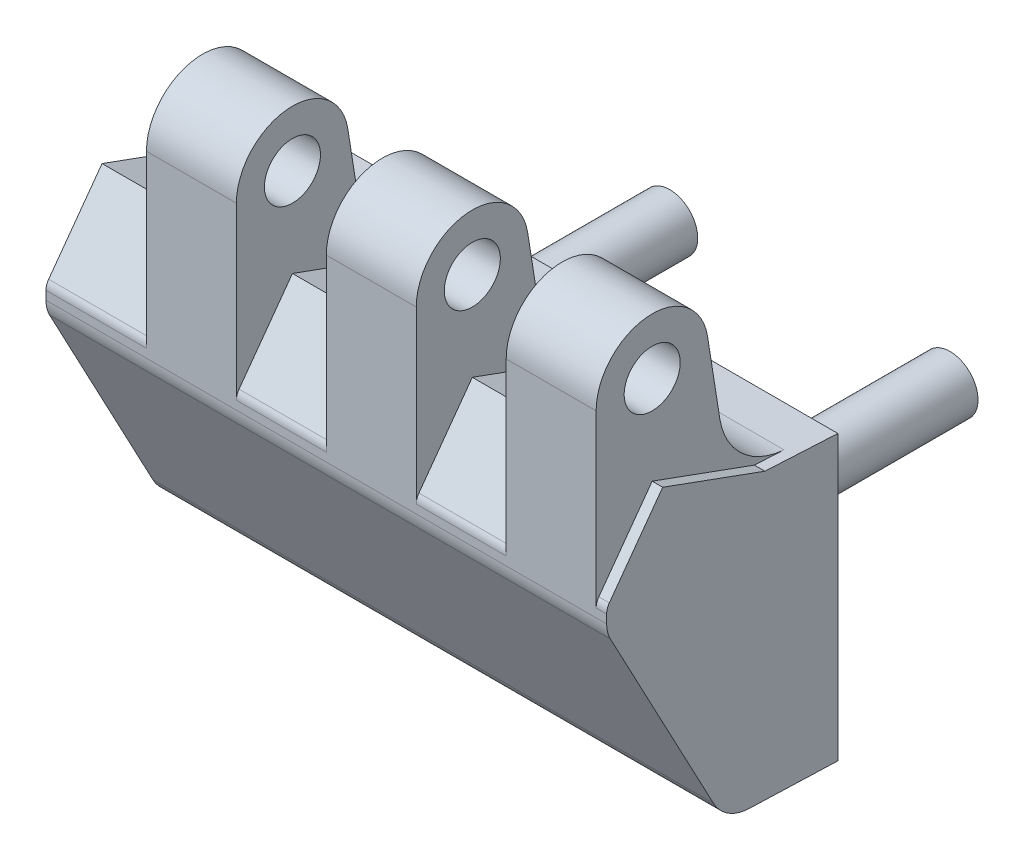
ISO-10303-21;
HEADER;
FILE_DESCRIPTION(('STEP AP214'),'2;1');
FILE_NAME('part.step','',(''),(''),'','','');
FILE_SCHEMA(('AUTOMOTIVE_DESIGN { 1 0 10303 214 1 1 1 1 }'));
ENDSEC;
DATA;
#1=APPLICATION_CONTEXT('core data for automotive mechanical design processes');
#2=APPLICATION_PROTOCOL_DEFINITION('international standard','automotive_design',2000,#1);
#3=PRODUCT_CONTEXT('',#1,'mechanical');
#4=PRODUCT('Part','Part','',(#3));
#5=PRODUCT_RELATED_PRODUCT_CATEGORY('part','',(#4));
#6=PRODUCT_DEFINITION_FORMATION('','',#4);
#7=PRODUCT_DEFINITION_CONTEXT('part definition',#1,'design');
#8=PRODUCT_DEFINITION('design','',#6,#7);
#9=PRODUCT_DEFINITION_SHAPE('','',#8);
#10=(LENGTH_UNIT() NAMED_UNIT(*) SI_UNIT(.MILLI.,.METRE.));
#11=(NAMED_UNIT(*) PLANE_ANGLE_UNIT() SI_UNIT($,.RADIAN.));
#12=(NAMED_UNIT(*) SI_UNIT($,.STERADIAN.) SOLID_ANGLE_UNIT());
#13=UNCERTAINTY_MEASURE_WITH_UNIT(LENGTH_MEASURE(1.E-05),#10,'distance_accuracy_value','');
#14=(GEOMETRIC_REPRESENTATION_CONTEXT(3) GLOBAL_UNCERTAINTY_ASSIGNED_CONTEXT((#13)) GLOBAL_UNIT_ASSIGNED_CONTEXT((#10,
#11,#12)) REPRESENTATION_CONTEXT('',''));
#15=CARTESIAN_POINT('',(0.,0.,0.));
#16=DIRECTION('',(0.,0.,1.));
#17=DIRECTION('',(1.,0.,0.));
#18=AXIS2_PLACEMENT_3D('',#15,#16,#17);
#19=CARTESIAN_POINT('',(-10.25,10.93,0.));
#20=DIRECTION('',(0.,0.998629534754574,-0.0523359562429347));
#21=DIRECTION('',(0.,0.0523359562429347,0.998629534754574));
#22=AXIS2_PLACEMENT_3D('',#19,#20,#21);
#23=PLANE('',#22);
#24=DIRECTION('',(1.,0.,0.));
#25=VECTOR('',#24,1.);
#26=CARTESIAN_POINT('',(-10.25,10.93,0.));
#27=LINE('',#26,#25);
#28=CARTESIAN_POINT('',(-10.,10.93,0.));
#29=VERTEX_POINT('',#28);
#30=CARTESIAN_POINT('',(30.,10.93,0.));
#31=VERTEX_POINT('',#30);
#32=EDGE_CURVE('E258',#29,#31,#27,.T.);
#33=ORIENTED_EDGE('',*,*,#32,.F.);
#34=DIRECTION('',(0.,-0.0523359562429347,-0.998629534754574));
#35=VECTOR('',#34,1.);
#36=CARTESIAN_POINT('',(-10.,11.2029078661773,5.2073922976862));
#37=LINE('',#36,#35);
#38=CARTESIAN_POINT('',(-10.,11.2029078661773,5.2073922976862));
#39=VERTEX_POINT('',#38);
#40=EDGE_CURVE('E240',#39,#29,#37,.T.);
#41=ORIENTED_EDGE('',*,*,#40,.F.);
#42=DIRECTION('',(1.,0.,0.));
#43=VECTOR('',#42,1.);
#44=CARTESIAN_POINT('',(-10.25,11.2029078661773,5.2073922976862));
#45=LINE('',#44,#43);
#46=CARTESIAN_POINT('',(-2.8333333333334,11.2029078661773,5.2073922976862));
#47=VERTEX_POINT('',#46);
#48=EDGE_CURVE('E261',#39,#47,#45,.T.);
#49=ORIENTED_EDGE('',*,*,#48,.T.);
#50=DIRECTION('',(0.,0.0523359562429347,0.998629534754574));
#51=VECTOR('',#50,1.);
#52=CARTESIAN_POINT('',(-2.8333333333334,10.93,0.));
#53=LINE('',#52,#51);
#54=CARTESIAN_POINT('',(-2.8333333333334,11.0922838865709,3.09656102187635));
#55=VERTEX_POINT('',#54);
#56=EDGE_CURVE('E282',#55,#47,#53,.T.);
#57=ORIENTED_EDGE('',*,*,#56,.F.);
#58=DIRECTION('',(1.,0.,0.));
#59=VECTOR('',#58,1.);
#60=CARTESIAN_POINT('',(-2.8333333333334,11.0922838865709,3.09656102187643));
#61=LINE('',#60,#59);
#62=CARTESIAN_POINT('',(3.5833333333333,11.0922838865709,3.09656102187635));
#63=VERTEX_POINT('',#62);
#64=EDGE_CURVE('E22',#63,#55,#61,.F.);
#65=ORIENTED_EDGE('',*,*,#64,.F.);
#66=DIRECTION('',(0.,0.0523359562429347,0.998629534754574));
#67=VECTOR('',#66,1.);
#68=CARTESIAN_POINT('',(3.5833333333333,10.93,0.));
#69=LINE('',#68,#67);
#70=CARTESIAN_POINT('',(3.5833333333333,11.2029078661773,5.2073922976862));
#71=VERTEX_POINT('',#70);
#72=EDGE_CURVE('E449',#63,#71,#69,.T.);
#73=ORIENTED_EDGE('',*,*,#72,.T.);
#74=CARTESIAN_POINT('',(10.,11.2029078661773,5.2073922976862));
#75=VERTEX_POINT('',#74);
#76=EDGE_CURVE('E375',#71,#75,#45,.T.);
#77=ORIENTED_EDGE('',*,*,#76,.T.);
#78=DIRECTION('',(0.,0.0523359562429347,0.998629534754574));
#79=VECTOR('',#78,1.);
#80=CARTESIAN_POINT('',(10.,10.93,0.));
#81=LINE('',#80,#79);
#82=CARTESIAN_POINT('',(10.,11.0922838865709,3.09656102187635));
#83=VERTEX_POINT('',#82);
#84=EDGE_CURVE('E343',#83,#75,#81,.T.);
#85=ORIENTED_EDGE('',*,*,#84,.F.);
#86=DIRECTION('',(-1.,0.,0.));
#87=VECTOR('',#86,1.);
#88=CARTESIAN_POINT('',(16.4166666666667,11.0922838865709,3.09656102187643));
#89=LINE('',#88,#87);
#90=CARTESIAN_POINT('',(16.4166666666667,11.0922838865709,3.09656102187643));
#91=VERTEX_POINT('',#90);
#92=EDGE_CURVE('E257',#83,#91,#89,.F.);
#93=ORIENTED_EDGE('',*,*,#92,.T.);
#94=DIRECTION('',(0.,0.0523359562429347,0.998629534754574));
#95=VECTOR('',#94,1.);
#96=CARTESIAN_POINT('',(16.4166666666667,10.93,0.));
#97=LINE('',#96,#95);
#98=CARTESIAN_POINT('',(16.4166666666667,11.2029078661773,5.2073922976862));
#99=VERTEX_POINT('',#98);
#100=EDGE_CURVE('E352',#91,#99,#97,.T.);
#101=ORIENTED_EDGE('',*,*,#100,.T.);
#102=CARTESIAN_POINT('',(22.833333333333,11.2029078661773,5.2073922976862));
#103=VERTEX_POINT('',#102);
#104=EDGE_CURVE('E376',#99,#103,#45,.T.);
#105=ORIENTED_EDGE('',*,*,#104,.T.);
#106=DIRECTION('',(0.,0.0523359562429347,0.998629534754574));
#107=VECTOR('',#106,1.);
#108=CARTESIAN_POINT('',(22.833333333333,10.93,0.));
#109=LINE('',#108,#107);
#110=CARTESIAN_POINT('',(22.833333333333,11.0922838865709,3.09656102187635));
#111=VERTEX_POINT('',#110);
#112=EDGE_CURVE('E381',#111,#103,#109,.T.);
#113=ORIENTED_EDGE('',*,*,#112,.F.);
#114=DIRECTION('',(-1.,0.,0.));
#115=VECTOR('',#114,1.);
#116=CARTESIAN_POINT('',(29.25,11.0922838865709,3.09656102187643));
#117=LINE('',#116,#115);
#118=CARTESIAN_POINT('',(29.25,11.0922838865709,3.09656102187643));
#119=VERTEX_POINT('',#118);
#120=EDGE_CURVE('E9',#111,#119,#117,.F.);
#121=ORIENTED_EDGE('',*,*,#120,.T.);
#122=DIRECTION('',(0.,0.0523359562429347,0.998629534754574));
#123=VECTOR('',#122,1.);
#124=CARTESIAN_POINT('',(29.25,10.93,0.));
#125=LINE('',#124,#123);
#126=CARTESIAN_POINT('',(29.25,11.2029078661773,5.2073922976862));
#127=VERTEX_POINT('',#126);
#128=EDGE_CURVE('E406',#119,#127,#125,.T.);
#129=ORIENTED_EDGE('',*,*,#128,.T.);
#130=CARTESIAN_POINT('',(30.,11.2029078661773,5.2073922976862));
#131=VERTEX_POINT('',#130);
#132=EDGE_CURVE('E372',#127,#131,#45,.T.);
#133=ORIENTED_EDGE('',*,*,#132,.T.);
#134=DIRECTION('',(0.,0.0523359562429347,0.998629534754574));
#135=VECTOR('',#134,1.);
#136=CARTESIAN_POINT('',(30.,10.93,0.));
#137=LINE('',#136,#135);
#138=EDGE_CURVE('E651',#31,#131,#137,.T.);
#139=ORIENTED_EDGE('',*,*,#138,.F.);
#140=EDGE_LOOP('',(#33,#41,#49,#57,#65,#73,#77,#85,#93,#101,#105,#113,#121,#129,#133,#139));
#141=FACE_BOUND('',#140,.T.);
#142=ADVANCED_FACE('F14',(#141),#23,.T.);
#143=CARTESIAN_POINT('',(-10.25,-9.07892726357,6.330694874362));
#144=DIRECTION('',(0.,-0.999390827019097,0.0348994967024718));
#145=DIRECTION('',(0.,-0.0348994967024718,-0.999390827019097));
#146=AXIS2_PLACEMENT_3D('',#143,#144,#145);
#147=PLANE('',#146);
#148=DIRECTION('',(1.,0.,0.));
#149=VECTOR('',#148,1.);
#150=CARTESIAN_POINT('',(-10.25,-9.07892726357,6.330694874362));
#151=LINE('',#150,#149);
#152=CARTESIAN_POINT('',(-10.,-9.07892726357,6.330694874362));
#153=VERTEX_POINT('',#152);
#154=CARTESIAN_POINT('',(30.,-9.07892726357,6.330694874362));
#155=VERTEX_POINT('',#154);
#156=EDGE_CURVE('E250',#153,#155,#151,.T.);
#157=ORIENTED_EDGE('',*,*,#156,.F.);
#158=DIRECTION('',(0.,0.0348994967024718,0.999390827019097));
#159=VECTOR('',#158,1.);
#160=CARTESIAN_POINT('',(-10.,-9.3,0.));
#161=LINE('',#160,#159);
#162=CARTESIAN_POINT('',(-10.,-9.3,0.));
#163=VERTEX_POINT('',#162);
#164=EDGE_CURVE('E237',#163,#153,#161,.T.);
#165=ORIENTED_EDGE('',*,*,#164,.F.);
#166=DIRECTION('',(1.,0.,0.));
#167=VECTOR('',#166,1.);
#168=CARTESIAN_POINT('',(-10.25,-9.3,0.));
#169=LINE('',#168,#167);
#170=CARTESIAN_POINT('',(30.,-9.3,0.));
#171=VERTEX_POINT('',#170);
#172=EDGE_CURVE('E248',#163,#171,#169,.T.);
#173=ORIENTED_EDGE('',*,*,#172,.T.);
#174=DIRECTION('',(0.,-0.0348994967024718,-0.999390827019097));
#175=VECTOR('',#174,1.);
#176=CARTESIAN_POINT('',(30.,-9.07892726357,6.330694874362));
#177=LINE('',#176,#175);
#178=EDGE_CURVE('E655',#155,#171,#177,.T.);
#179=ORIENTED_EDGE('',*,*,#178,.F.);
#180=EDGE_LOOP('',(#157,#165,#173,#179));
#181=FACE_BOUND('',#180,.T.);
#182=ADVANCED_FACE('F16',(#181),#147,.T.);
#183=CARTESIAN_POINT('',(-10.25,-9.3,0.));
#184=DIRECTION('',(0.,0.,-1.));
#185=DIRECTION('',(-1.,0.,0.));
#186=AXIS2_PLACEMENT_3D('',#183,#184,#185);
#187=PLANE('',#186);
#188=CARTESIAN_POINT('',(0.,0.,0.));
#189=DIRECTION('',(0.,0.,-1.));
#190=DIRECTION('',(-1.,0.,0.));
#191=AXIS2_PLACEMENT_3D('',#188,#189,#190);
#192=CIRCLE('',#191,2.);
#193=CARTESIAN_POINT('',(-2.,0.,0.));
#194=VERTEX_POINT('',#193);
#195=EDGE_CURVE('E586',#194,#194,#192,.T.);
#196=ORIENTED_EDGE('',*,*,#195,.F.);
#197=EDGE_LOOP('',(#196));
#198=FACE_BOUND('',#197,.T.);
#199=CARTESIAN_POINT('',(20.,0.,0.));
#200=DIRECTION('',(0.,0.,-1.));
#201=DIRECTION('',(-1.,0.,0.));
#202=AXIS2_PLACEMENT_3D('',#199,#200,#201);
#203=CIRCLE('',#202,2.);
#204=CARTESIAN_POINT('',(18.,0.,0.));
#205=VERTEX_POINT('',#204);
#206=EDGE_CURVE('E589',#205,#205,#203,.T.);
#207=ORIENTED_EDGE('',*,*,#206,.F.);
#208=EDGE_LOOP('',(#207));
#209=FACE_BOUND('',#208,.T.);
#210=ORIENTED_EDGE('',*,*,#172,.F.);
#211=DIRECTION('',(0.,-1.,0.));
#212=VECTOR('',#211,1.);
#213=CARTESIAN_POINT('',(-10.,10.93,0.));
#214=LINE('',#213,#212);
#215=EDGE_CURVE('E234',#29,#163,#214,.T.);
#216=ORIENTED_EDGE('',*,*,#215,.F.);
#217=ORIENTED_EDGE('',*,*,#32,.T.);
#218=DIRECTION('',(0.,1.,0.));
#219=VECTOR('',#218,1.);
#220=CARTESIAN_POINT('',(30.,-9.3,0.));
#221=LINE('',#220,#219);
#222=EDGE_CURVE('E256',#171,#31,#221,.T.);
#223=ORIENTED_EDGE('',*,*,#222,.F.);
#224=EDGE_LOOP('',(#210,#216,#217,#223));
#225=FACE_BOUND('',#224,.T.);
#226=ADVANCED_FACE('F254',(#198,#209,#225),#187,.T.);
#227=CARTESIAN_POINT('',(-10.25,8.026752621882,16.5));
#228=DIRECTION('',(0.,0.,1.));
#229=DIRECTION('',(1.,0.,0.));
#230=AXIS2_PLACEMENT_3D('',#227,#228,#229);
#231=PLANE('',#230);
#232=DIRECTION('',(1.,0.,0.));
#233=VECTOR('',#232,1.);
#234=CARTESIAN_POINT('',(-10.25,8.026752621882,16.5));
#235=LINE('',#234,#233);
#236=CARTESIAN_POINT('',(-10.,8.026752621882,16.5));
#237=VERTEX_POINT('',#236);
#238=CARTESIAN_POINT('',(-2.8333333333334,8.026752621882,16.5));
#239=VERTEX_POINT('',#238);
#240=EDGE_CURVE('E361',#237,#239,#235,.T.);
#241=ORIENTED_EDGE('',*,*,#240,.F.);
#242=DIRECTION('',(0.,1.,0.));
#243=VECTOR('',#242,1.);
#244=CARTESIAN_POINT('',(-10.,7.41266032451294,16.5));
#245=LINE('',#244,#243);
#246=CARTESIAN_POINT('',(-10.,7.41266032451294,16.5));
#247=VERTEX_POINT('',#246);
#248=EDGE_CURVE('E29',#247,#237,#245,.T.);
#249=ORIENTED_EDGE('',*,*,#248,.F.);
#250=DIRECTION('',(1.,0.,0.));
#251=VECTOR('',#250,1.);
#252=CARTESIAN_POINT('',(-10.25,7.412660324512,16.5));
#253=LINE('',#252,#251);
#254=CARTESIAN_POINT('',(30.,7.412660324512,16.5));
#255=VERTEX_POINT('',#254);
#256=EDGE_CURVE('E358',#247,#255,#253,.T.);
#257=ORIENTED_EDGE('',*,*,#256,.T.);
#258=DIRECTION('',(0.,-1.,0.));
#259=VECTOR('',#258,1.);
#260=CARTESIAN_POINT('',(30.,8.026752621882,16.5));
#261=LINE('',#260,#259);
#262=CARTESIAN_POINT('',(30.,8.026752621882,16.5));
#263=VERTEX_POINT('',#262);
#264=EDGE_CURVE('E538',#263,#255,#261,.T.);
#265=ORIENTED_EDGE('',*,*,#264,.F.);
#266=CARTESIAN_POINT('',(29.25,8.026752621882,16.5));
#267=VERTEX_POINT('',#266);
#268=EDGE_CURVE('E360',#267,#263,#235,.T.);
#269=ORIENTED_EDGE('',*,*,#268,.F.);
#270=DIRECTION('',(0.,-1.,0.));
#271=VECTOR('',#270,1.);
#272=CARTESIAN_POINT('',(29.25,20.2,16.5));
#273=LINE('',#272,#271);
#274=CARTESIAN_POINT('',(29.25,20.2,16.5));
#275=VERTEX_POINT('',#274);
#276=EDGE_CURVE('E529',#275,#267,#273,.T.);
#277=ORIENTED_EDGE('',*,*,#276,.F.);
#278=DIRECTION('',(-1.,0.,0.));
#279=VECTOR('',#278,1.);
#280=CARTESIAN_POINT('',(29.25,20.2,16.5));
#281=LINE('',#280,#279);
#282=CARTESIAN_POINT('',(22.833333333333,20.2,16.5));
#283=VERTEX_POINT('',#282);
#284=EDGE_CURVE('E625',#275,#283,#281,.T.);
#285=ORIENTED_EDGE('',*,*,#284,.T.);
#286=DIRECTION('',(0.,-1.,0.));
#287=VECTOR('',#286,1.);
#288=CARTESIAN_POINT('',(22.833333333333,20.2,16.5));
#289=LINE('',#288,#287);
#290=CARTESIAN_POINT('',(22.833333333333,8.026752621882,16.5));
#291=VERTEX_POINT('',#290);
#292=EDGE_CURVE('E593',#283,#291,#289,.T.);
#293=ORIENTED_EDGE('',*,*,#292,.T.);
#294=CARTESIAN_POINT('',(16.4166666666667,8.026752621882,16.5));
#295=VERTEX_POINT('',#294);
#296=EDGE_CURVE('E365',#295,#291,#235,.T.);
#297=ORIENTED_EDGE('',*,*,#296,.F.);
#298=DIRECTION('',(0.,-1.,0.));
#299=VECTOR('',#298,1.);
#300=CARTESIAN_POINT('',(16.4166666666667,20.2,16.5));
#301=LINE('',#300,#299);
#302=CARTESIAN_POINT('',(16.4166666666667,20.2,16.5));
#303=VERTEX_POINT('',#302);
#304=EDGE_CURVE('E313',#303,#295,#301,.T.);
#305=ORIENTED_EDGE('',*,*,#304,.F.);
#306=DIRECTION('',(-1.,0.,0.));
#307=VECTOR('',#306,1.);
#308=CARTESIAN_POINT('',(16.4166666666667,20.2,16.5));
#309=LINE('',#308,#307);
#310=CARTESIAN_POINT('',(10.,20.2,16.5));
#311=VERTEX_POINT('',#310);
#312=EDGE_CURVE('E325',#303,#311,#309,.T.);
#313=ORIENTED_EDGE('',*,*,#312,.T.);
#314=DIRECTION('',(0.,-1.,0.));
#315=VECTOR('',#314,1.);
#316=CARTESIAN_POINT('',(10.,20.2,16.5));
#317=LINE('',#316,#315);
#318=CARTESIAN_POINT('',(10.,8.026752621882,16.5));
#319=VERTEX_POINT('',#318);
#320=EDGE_CURVE('E290',#311,#319,#317,.T.);
#321=ORIENTED_EDGE('',*,*,#320,.T.);
#322=CARTESIAN_POINT('',(3.5833333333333,8.026752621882,16.5));
#323=VERTEX_POINT('',#322);
#324=EDGE_CURVE('E364',#323,#319,#235,.T.);
#325=ORIENTED_EDGE('',*,*,#324,.F.);
#326=DIRECTION('',(0.,-1.,0.));
#327=VECTOR('',#326,1.);
#328=CARTESIAN_POINT('',(3.5833333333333,20.2,16.5));
#329=LINE('',#328,#327);
#330=CARTESIAN_POINT('',(3.5833333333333,20.2,16.5));
#331=VERTEX_POINT('',#330);
#332=EDGE_CURVE('E408',#331,#323,#329,.T.);
#333=ORIENTED_EDGE('',*,*,#332,.F.);
#334=DIRECTION('',(1.,0.,0.));
#335=VECTOR('',#334,1.);
#336=CARTESIAN_POINT('',(-2.8333333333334,20.2,16.5));
#337=LINE('',#336,#335);
#338=CARTESIAN_POINT('',(-2.8333333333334,20.2,16.5));
#339=VERTEX_POINT('',#338);
#340=EDGE_CURVE('E434',#339,#331,#337,.T.);
#341=ORIENTED_EDGE('',*,*,#340,.F.);
#342=DIRECTION('',(0.,-1.,0.));
#343=VECTOR('',#342,1.);
#344=CARTESIAN_POINT('',(-2.8333333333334,20.2,16.5));
#345=LINE('',#344,#343);
#346=EDGE_CURVE('E287',#339,#239,#345,.T.);
#347=ORIENTED_EDGE('',*,*,#346,.T.);
#348=EDGE_LOOP('',(#241,#249,#257,#265,#269,#277,#285,#293,#297,#305,#313,#321,#325,#333,#341,#347));
#349=FACE_BOUND('',#348,.T.);
#350=ADVANCED_FACE('F465',(#349),#231,.T.);
#351=CARTESIAN_POINT('',(-10.25,7.41266032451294,14.2499999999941));
#352=DIRECTION('',(1.,0.,0.));
#353=DIRECTION('',(0.,1.,0.));
#354=AXIS2_PLACEMENT_3D('',#351,#352,#353);
#355=CYLINDRICAL_SURFACE('',#354,2.25000000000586);
#356=ORIENTED_EDGE('',*,*,#256,.F.);
#357=CARTESIAN_POINT('',(-10.,7.41266032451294,14.2499999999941));
#358=DIRECTION('',(-1.,0.,0.));
#359=DIRECTION('',(0.,0.,1.));
#360=AXIS2_PLACEMENT_3D('',#357,#358,#359);
#361=CIRCLE('',#360,2.25000000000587);
#362=CARTESIAN_POINT('',(-10.,6.356349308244,16.236632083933));
#363=VERTEX_POINT('',#362);
#364=EDGE_CURVE('E1371',#363,#247,#361,.T.);
#365=ORIENTED_EDGE('',*,*,#364,.F.);
#366=DIRECTION('',(1.,0.,0.));
#367=VECTOR('',#366,1.);
#368=CARTESIAN_POINT('',(-10.25,6.356349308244,16.236632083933));
#369=LINE('',#368,#367);
#370=CARTESIAN_POINT('',(30.,6.356349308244,16.236632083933));
#371=VERTEX_POINT('',#370);
#372=EDGE_CURVE('E356',#363,#371,#369,.T.);
#373=ORIENTED_EDGE('',*,*,#372,.T.);
#374=CARTESIAN_POINT('',(30.,7.41266032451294,14.2499999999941));
#375=DIRECTION('',(1.,0.,0.));
#376=DIRECTION('',(0.,0.,-1.));
#377=AXIS2_PLACEMENT_3D('',#374,#375,#376);
#378=CIRCLE('',#377,2.25000000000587);
#379=EDGE_CURVE('E663',#255,#371,#378,.T.);
#380=ORIENTED_EDGE('',*,*,#379,.F.);
#381=EDGE_LOOP('',(#356,#365,#373,#380));
#382=FACE_BOUND('',#381,.T.);
#383=ADVANCED_FACE('F581',(#382),#355,.T.);
#384=CARTESIAN_POINT('',(-10.25,6.356349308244,16.236632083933));
#385=DIRECTION('',(0.,-0.469471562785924,0.882947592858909));
#386=DIRECTION('',(0.,-0.882947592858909,-0.469471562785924));
#387=AXIS2_PLACEMENT_3D('',#384,#385,#386);
#388=PLANE('',#387);
#389=ORIENTED_EDGE('',*,*,#372,.F.);
#390=DIRECTION('',(0.,0.882947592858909,0.469471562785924));
#391=VECTOR('',#390,1.);
#392=CARTESIAN_POINT('',(-10.,-7.48916947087,8.8748391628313));
#393=LINE('',#392,#391);
#394=CARTESIAN_POINT('',(-10.,-7.48916947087,8.8748391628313));
#395=VERTEX_POINT('',#394);
#396=EDGE_CURVE('E1375',#395,#363,#393,.T.);
#397=ORIENTED_EDGE('',*,*,#396,.F.);
#398=DIRECTION('',(1.,0.,0.));
#399=VECTOR('',#398,1.);
#400=CARTESIAN_POINT('',(-10.25,-7.48916947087,8.8748391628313));
#401=LINE('',#400,#399);
#402=CARTESIAN_POINT('',(30.,-7.48916947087,8.8748391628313));
#403=VERTEX_POINT('',#402);
#404=EDGE_CURVE('E37',#395,#403,#401,.T.);
#405=ORIENTED_EDGE('',*,*,#404,.T.);
#406=DIRECTION('',(0.,-0.882947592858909,-0.469471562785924));
#407=VECTOR('',#406,1.);
#408=CARTESIAN_POINT('',(30.,6.356349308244,16.236632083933));
#409=LINE('',#408,#407);
#410=EDGE_CURVE('E666',#371,#403,#409,.T.);
#411=ORIENTED_EDGE('',*,*,#410,.F.);
#412=EDGE_LOOP('',(#389,#397,#405,#411));
#413=FACE_BOUND('',#412,.T.);
#414=ADVANCED_FACE('F966',(#413),#388,.T.);
#415=CARTESIAN_POINT('',(-10.25,-6.08075478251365,6.22599638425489));
#416=DIRECTION('',(1.,0.,0.));
#417=DIRECTION('',(0.,1.,0.));
#418=AXIS2_PLACEMENT_3D('',#415,#416,#417);
#419=CYLINDRICAL_SURFACE('',#418,2.99999999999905);
#420=ORIENTED_EDGE('',*,*,#404,.F.);
#421=CARTESIAN_POINT('',(-10.,-6.08075478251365,6.22599638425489));
#422=DIRECTION('',(-1.,0.,0.));
#423=DIRECTION('',(0.,0.,1.));
#424=AXIS2_PLACEMENT_3D('',#421,#422,#423);
#425=CIRCLE('',#424,2.99999999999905);
#426=EDGE_CURVE('E251',#153,#395,#425,.T.);
#427=ORIENTED_EDGE('',*,*,#426,.F.);
#428=ORIENTED_EDGE('',*,*,#156,.T.);
#429=CARTESIAN_POINT('',(30.,-6.08075478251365,6.22599638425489));
#430=DIRECTION('',(1.,0.,0.));
#431=DIRECTION('',(0.,0.,-1.));
#432=AXIS2_PLACEMENT_3D('',#429,#430,#431);
#433=CIRCLE('',#432,2.99999999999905);
#434=EDGE_CURVE('E1377',#403,#155,#433,.T.);
#435=ORIENTED_EDGE('',*,*,#434,.F.);
#436=EDGE_LOOP('',(#420,#427,#428,#435));
#437=FACE_BOUND('',#436,.T.);
#438=ADVANCED_FACE('F956',(#437),#419,.T.);
#439=CARTESIAN_POINT('',(-10.25,11.2029078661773,5.2073922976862));
#440=DIRECTION('',(0.,0.939692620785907,-0.342020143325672));
#441=DIRECTION('',(0.,0.342020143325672,0.939692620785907));
#442=AXIS2_PLACEMENT_3D('',#439,#440,#441);
#443=PLANE('',#442);
#444=ORIENTED_EDGE('',*,*,#48,.F.);
#445=DIRECTION('',(0.,-0.342020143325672,-0.939692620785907));
#446=VECTOR('',#445,1.);
#447=CARTESIAN_POINT('',(-10.,13.8572,12.5));
#448=LINE('',#447,#446);
#449=CARTESIAN_POINT('',(-10.,13.8572,12.5));
#450=VERTEX_POINT('',#449);
#451=EDGE_CURVE('E1379',#450,#39,#448,.T.);
#452=ORIENTED_EDGE('',*,*,#451,.F.);
#453=DIRECTION('',(1.,0.,0.));
#454=VECTOR('',#453,1.);
#455=CARTESIAN_POINT('',(-10.25,13.8572,12.5));
#456=LINE('',#455,#454);
#457=CARTESIAN_POINT('',(-2.8333333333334,13.8572,12.5));
#458=VERTEX_POINT('',#457);
#459=EDGE_CURVE('E371',#450,#458,#456,.T.);
#460=ORIENTED_EDGE('',*,*,#459,.T.);
#461=DIRECTION('',(0.,0.342020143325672,0.939692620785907));
#462=VECTOR('',#461,1.);
#463=CARTESIAN_POINT('',(-2.8333333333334,11.2029078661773,5.2073922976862));
#464=LINE('',#463,#462);
#465=EDGE_CURVE('E291',#47,#458,#464,.T.);
#466=ORIENTED_EDGE('',*,*,#465,.F.);
#467=EDGE_LOOP('',(#444,#452,#460,#466));
#468=FACE_BOUND('',#467,.T.);
#469=ADVANCED_FACE('F573',(#468),#443,.T.);
#470=CARTESIAN_POINT('',(-10.25,13.8572,12.5));
#471=DIRECTION('',(0.,0.587785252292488,0.809016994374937));
#472=DIRECTION('',(0.,-0.809016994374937,0.587785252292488));
#473=AXIS2_PLACEMENT_3D('',#470,#471,#472);
#474=PLANE('',#473);
#475=ORIENTED_EDGE('',*,*,#459,.F.);
#476=DIRECTION('',(0.,0.809016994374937,-0.587785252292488));
#477=VECTOR('',#476,1.);
#478=CARTESIAN_POINT('',(-10.,8.614537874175,16.309016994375));
#479=LINE('',#478,#477);
#480=CARTESIAN_POINT('',(-10.,8.614537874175,16.309016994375));
#481=VERTEX_POINT('',#480);
#482=EDGE_CURVE('E1383',#481,#450,#479,.T.);
#483=ORIENTED_EDGE('',*,*,#482,.F.);
#484=DIRECTION('',(1.,0.,0.));
#485=VECTOR('',#484,1.);
#486=CARTESIAN_POINT('',(-10.25,8.614537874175,16.309016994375));
#487=LINE('',#486,#485);
#488=CARTESIAN_POINT('',(-2.8333333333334,8.614537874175,16.309016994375));
#489=VERTEX_POINT('',#488);
#490=EDGE_CURVE('E366',#481,#489,#487,.T.);
#491=ORIENTED_EDGE('',*,*,#490,.T.);
#492=DIRECTION('',(0.,-0.809016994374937,0.587785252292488));
#493=VECTOR('',#492,1.);
#494=CARTESIAN_POINT('',(-2.8333333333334,13.8572,12.5));
#495=LINE('',#494,#493);
#496=EDGE_CURVE('E297',#458,#489,#495,.T.);
#497=ORIENTED_EDGE('',*,*,#496,.F.);
#498=EDGE_LOOP('',(#475,#483,#491,#497));
#499=FACE_BOUND('',#498,.T.);
#500=ADVANCED_FACE('F874',(#499),#474,.T.);
#501=CARTESIAN_POINT('',(-10.25,8.02675262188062,15.4999999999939));
#502=DIRECTION('',(1.,0.,0.));
#503=DIRECTION('',(0.,1.,0.));
#504=AXIS2_PLACEMENT_3D('',#501,#502,#503);
#505=CYLINDRICAL_SURFACE('',#504,1.00000000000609);
#506=ORIENTED_EDGE('',*,*,#490,.F.);
#507=CARTESIAN_POINT('',(-10.,8.02675262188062,15.4999999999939));
#508=DIRECTION('',(-1.,0.,0.));
#509=DIRECTION('',(0.,0.,1.));
#510=AXIS2_PLACEMENT_3D('',#507,#508,#509);
#511=CIRCLE('',#510,1.0000000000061);
#512=EDGE_CURVE('E463',#237,#481,#511,.T.);
#513=ORIENTED_EDGE('',*,*,#512,.F.);
#514=ORIENTED_EDGE('',*,*,#240,.T.);
#515=CARTESIAN_POINT('',(-2.8333333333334,8.02675262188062,15.4999999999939));
#516=DIRECTION('',(-1.,0.,0.));
#517=DIRECTION('',(0.,-1.,0.));
#518=AXIS2_PLACEMENT_3D('',#515,#516,#517);
#519=CIRCLE('',#518,1.00000000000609);
#520=EDGE_CURVE('E451',#489,#239,#519,.F.);
#521=ORIENTED_EDGE('',*,*,#520,.F.);
#522=EDGE_LOOP('',(#506,#513,#514,#521));
#523=FACE_BOUND('',#522,.T.);
#524=ADVANCED_FACE('F461',(#523),#505,.T.);
#525=CARTESIAN_POINT('',(29.25,13.8572,12.5));
#526=VERTEX_POINT('',#525);
#527=CARTESIAN_POINT('',(30.,13.8572,12.5));
#528=VERTEX_POINT('',#527);
#529=EDGE_CURVE('E368',#526,#528,#456,.T.);
#530=ORIENTED_EDGE('',*,*,#529,.T.);
#531=DIRECTION('',(0.,0.342020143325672,0.939692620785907));
#532=VECTOR('',#531,1.);
#533=CARTESIAN_POINT('',(30.,11.2029078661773,5.2073922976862));
#534=LINE('',#533,#532);
#535=EDGE_CURVE('E513',#131,#528,#534,.T.);
#536=ORIENTED_EDGE('',*,*,#535,.F.);
#537=ORIENTED_EDGE('',*,*,#132,.F.);
#538=DIRECTION('',(0.,0.342020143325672,0.939692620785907));
#539=VECTOR('',#538,1.);
#540=CARTESIAN_POINT('',(29.25,11.2029078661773,5.2073922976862));
#541=LINE('',#540,#539);
#542=EDGE_CURVE('E404',#127,#526,#541,.T.);
#543=ORIENTED_EDGE('',*,*,#542,.T.);
#544=EDGE_LOOP('',(#530,#536,#537,#543));
#545=FACE_BOUND('',#544,.T.);
#546=ADVANCED_FACE('F511',(#545),#443,.T.);
#547=CARTESIAN_POINT('',(29.25,8.614537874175,16.309016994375));
#548=VERTEX_POINT('',#547);
#549=CARTESIAN_POINT('',(30.,8.614537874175,16.309016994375));
#550=VERTEX_POINT('',#549);
#551=EDGE_CURVE('E363',#548,#550,#487,.T.);
#552=ORIENTED_EDGE('',*,*,#551,.T.);
#553=DIRECTION('',(0.,-0.809016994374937,0.587785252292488));
#554=VECTOR('',#553,1.);
#555=CARTESIAN_POINT('',(30.,13.8572,12.5));
#556=LINE('',#555,#554);
#557=EDGE_CURVE('E521',#528,#550,#556,.T.);
#558=ORIENTED_EDGE('',*,*,#557,.F.);
#559=ORIENTED_EDGE('',*,*,#529,.F.);
#560=DIRECTION('',(0.,-0.809016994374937,0.587785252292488));
#561=VECTOR('',#560,1.);
#562=CARTESIAN_POINT('',(29.25,13.8572,12.5));
#563=LINE('',#562,#561);
#564=EDGE_CURVE('E397',#526,#548,#563,.T.);
#565=ORIENTED_EDGE('',*,*,#564,.T.);
#566=EDGE_LOOP('',(#552,#558,#559,#565));
#567=FACE_BOUND('',#566,.T.);
#568=ADVANCED_FACE('F519',(#567),#474,.T.);
#569=ORIENTED_EDGE('',*,*,#268,.T.);
#570=CARTESIAN_POINT('',(30.,8.02675262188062,15.4999999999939));
#571=DIRECTION('',(1.,0.,0.));
#572=DIRECTION('',(0.,0.,-1.));
#573=AXIS2_PLACEMENT_3D('',#570,#571,#572);
#574=CIRCLE('',#573,1.0000000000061);
#575=EDGE_CURVE('E660',#550,#263,#574,.T.);
#576=ORIENTED_EDGE('',*,*,#575,.F.);
#577=ORIENTED_EDGE('',*,*,#551,.F.);
#578=CARTESIAN_POINT('',(29.25,8.02675262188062,15.4999999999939));
#579=DIRECTION('',(-1.,0.,0.));
#580=DIRECTION('',(0.,-1.,0.));
#581=AXIS2_PLACEMENT_3D('',#578,#579,#580);
#582=CIRCLE('',#581,1.00000000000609);
#583=EDGE_CURVE('E395',#548,#267,#582,.F.);
#584=ORIENTED_EDGE('',*,*,#583,.T.);
#585=EDGE_LOOP('',(#569,#576,#577,#584));
#586=FACE_BOUND('',#585,.T.);
#587=ADVANCED_FACE('F533',(#586),#505,.T.);
#588=ORIENTED_EDGE('',*,*,#76,.F.);
#589=DIRECTION('',(0.,0.342020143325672,0.939692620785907));
#590=VECTOR('',#589,1.);
#591=CARTESIAN_POINT('',(3.5833333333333,11.2029078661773,5.2073922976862));
#592=LINE('',#591,#590);
#593=CARTESIAN_POINT('',(3.5833333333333,13.8572,12.5));
#594=VERTEX_POINT('',#593);
#595=EDGE_CURVE('E446',#71,#594,#592,.T.);
#596=ORIENTED_EDGE('',*,*,#595,.T.);
#597=CARTESIAN_POINT('',(10.,13.8572,12.5));
#598=VERTEX_POINT('',#597);
#599=EDGE_CURVE('E373',#594,#598,#456,.T.);
#600=ORIENTED_EDGE('',*,*,#599,.T.);
#601=DIRECTION('',(0.,0.342020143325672,0.939692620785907));
#602=VECTOR('',#601,1.);
#603=CARTESIAN_POINT('',(10.,11.2029078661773,5.2073922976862));
#604=LINE('',#603,#602);
#605=EDGE_CURVE('E340',#75,#598,#604,.T.);
#606=ORIENTED_EDGE('',*,*,#605,.F.);
#607=EDGE_LOOP('',(#588,#596,#600,#606));
#608=FACE_BOUND('',#607,.T.);
#609=ADVANCED_FACE('F480',(#608),#443,.T.);
#610=ORIENTED_EDGE('',*,*,#599,.F.);
#611=DIRECTION('',(0.,-0.809016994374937,0.587785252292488));
#612=VECTOR('',#611,1.);
#613=CARTESIAN_POINT('',(3.5833333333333,13.8572,12.5));
#614=LINE('',#613,#612);
#615=CARTESIAN_POINT('',(3.5833333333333,8.614537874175,16.309016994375));
#616=VERTEX_POINT('',#615);
#617=EDGE_CURVE('E443',#594,#616,#614,.T.);
#618=ORIENTED_EDGE('',*,*,#617,.T.);
#619=CARTESIAN_POINT('',(10.,8.614537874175,16.309016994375));
#620=VERTEX_POINT('',#619);
#621=EDGE_CURVE('E369',#616,#620,#487,.T.);
#622=ORIENTED_EDGE('',*,*,#621,.T.);
#623=DIRECTION('',(0.,-0.809016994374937,0.587785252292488));
#624=VECTOR('',#623,1.);
#625=CARTESIAN_POINT('',(10.,13.8572,12.5));
#626=LINE('',#625,#624);
#627=EDGE_CURVE('E337',#598,#620,#626,.T.);
#628=ORIENTED_EDGE('',*,*,#627,.F.);
#629=EDGE_LOOP('',(#610,#618,#622,#628));
#630=FACE_BOUND('',#629,.T.);
#631=ADVANCED_FACE('F875',(#630),#474,.T.);
#632=ORIENTED_EDGE('',*,*,#621,.F.);
#633=CARTESIAN_POINT('',(3.5833333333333,8.02675262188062,15.4999999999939));
#634=DIRECTION('',(-1.,0.,0.));
#635=DIRECTION('',(0.,-1.,0.));
#636=AXIS2_PLACEMENT_3D('',#633,#634,#635);
#637=CIRCLE('',#636,1.00000000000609);
#638=EDGE_CURVE('E440',#616,#323,#637,.F.);
#639=ORIENTED_EDGE('',*,*,#638,.T.);
#640=ORIENTED_EDGE('',*,*,#324,.T.);
#641=CARTESIAN_POINT('',(10.,8.02675262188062,15.4999999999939));
#642=DIRECTION('',(-1.,0.,0.));
#643=DIRECTION('',(0.,-1.,0.));
#644=AXIS2_PLACEMENT_3D('',#641,#642,#643);
#645=CIRCLE('',#644,1.00000000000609);
#646=EDGE_CURVE('E334',#620,#319,#645,.F.);
#647=ORIENTED_EDGE('',*,*,#646,.F.);
#648=EDGE_LOOP('',(#632,#639,#640,#647));
#649=FACE_BOUND('',#648,.T.);
#650=ADVANCED_FACE('F543',(#649),#505,.T.);
#651=DIRECTION('',(0.,0.342020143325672,0.939692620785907));
#652=VECTOR('',#651,1.);
#653=CARTESIAN_POINT('',(22.833333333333,11.2029078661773,5.2073922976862));
#654=LINE('',#653,#652);
#655=CARTESIAN_POINT('',(22.833333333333,13.8572,12.5));
#656=VERTEX_POINT('',#655);
#657=EDGE_CURVE('E392',#103,#656,#654,.T.);
#658=ORIENTED_EDGE('',*,*,#657,.F.);
#659=ORIENTED_EDGE('',*,*,#104,.F.);
#660=DIRECTION('',(0.,0.342020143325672,0.939692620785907));
#661=VECTOR('',#660,1.);
#662=CARTESIAN_POINT('',(16.4166666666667,11.2029078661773,5.2073922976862));
#663=LINE('',#662,#661);
#664=CARTESIAN_POINT('',(16.4166666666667,13.8572,12.5));
#665=VERTEX_POINT('',#664);
#666=EDGE_CURVE('E350',#99,#665,#663,.T.);
#667=ORIENTED_EDGE('',*,*,#666,.T.);
#668=EDGE_CURVE('E374',#665,#656,#456,.T.);
#669=ORIENTED_EDGE('',*,*,#668,.T.);
#670=EDGE_LOOP('',(#658,#659,#667,#669));
#671=FACE_BOUND('',#670,.T.);
#672=ADVANCED_FACE('F502',(#671),#443,.T.);
#673=DIRECTION('',(0.,-0.809016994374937,0.587785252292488));
#674=VECTOR('',#673,1.);
#675=CARTESIAN_POINT('',(22.833333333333,13.8572,12.5));
#676=LINE('',#675,#674);
#677=CARTESIAN_POINT('',(22.833333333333,8.614537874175,16.309016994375));
#678=VERTEX_POINT('',#677);
#679=EDGE_CURVE('E399',#656,#678,#676,.T.);
#680=ORIENTED_EDGE('',*,*,#679,.F.);
#681=ORIENTED_EDGE('',*,*,#668,.F.);
#682=DIRECTION('',(0.,-0.809016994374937,0.587785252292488));
#683=VECTOR('',#682,1.);
#684=CARTESIAN_POINT('',(16.4166666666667,13.8572,12.5));
#685=LINE('',#684,#683);
#686=CARTESIAN_POINT('',(16.4166666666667,8.614537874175,16.309016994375));
#687=VERTEX_POINT('',#686);
#688=EDGE_CURVE('E348',#665,#687,#685,.T.);
#689=ORIENTED_EDGE('',*,*,#688,.T.);
#690=EDGE_CURVE('E370',#687,#678,#487,.T.);
#691=ORIENTED_EDGE('',*,*,#690,.T.);
#692=EDGE_LOOP('',(#680,#681,#689,#691));
#693=FACE_BOUND('',#692,.T.);
#694=ADVANCED_FACE('F504',(#693),#474,.T.);
#695=CARTESIAN_POINT('',(22.833333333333,8.02675262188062,15.4999999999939));
#696=DIRECTION('',(-1.,0.,0.));
#697=DIRECTION('',(0.,-1.,0.));
#698=AXIS2_PLACEMENT_3D('',#695,#696,#697);
#699=CIRCLE('',#698,1.00000000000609);
#700=EDGE_CURVE('E633',#678,#291,#699,.F.);
#701=ORIENTED_EDGE('',*,*,#700,.F.);
#702=ORIENTED_EDGE('',*,*,#690,.F.);
#703=CARTESIAN_POINT('',(16.4166666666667,8.02675262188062,15.4999999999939));
#704=DIRECTION('',(-1.,0.,0.));
#705=DIRECTION('',(0.,-1.,0.));
#706=AXIS2_PLACEMENT_3D('',#703,#704,#705);
#707=CIRCLE('',#706,1.00000000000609);
#708=EDGE_CURVE('E346',#687,#295,#707,.F.);
#709=ORIENTED_EDGE('',*,*,#708,.T.);
#710=ORIENTED_EDGE('',*,*,#296,.T.);
#711=EDGE_LOOP('',(#701,#702,#709,#710));
#712=FACE_BOUND('',#711,.T.);
#713=ADVANCED_FACE('F564',(#712),#505,.T.);
#714=CARTESIAN_POINT('',(16.4166666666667,16.0792045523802,2.735143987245));
#715=DIRECTION('',(-1.,0.,0.));
#716=DIRECTION('',(0.,-1.,0.));
#717=AXIS2_PLACEMENT_3D('',#714,#715,#716);
#718=CYLINDRICAL_SURFACE('',#717,4.99999999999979);
#719=ORIENTED_EDGE('',*,*,#92,.F.);
#720=CARTESIAN_POINT('',(10.,16.0792045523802,2.735143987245));
#721=DIRECTION('',(-1.,0.,0.));
#722=DIRECTION('',(0.,1.,0.));
#723=AXIS2_PLACEMENT_3D('',#720,#721,#722);
#724=CIRCLE('',#723,4.99999999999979);
#725=CARTESIAN_POINT('',(10.,15.2970322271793,7.6735856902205));
#726=VERTEX_POINT('',#725);
#727=EDGE_CURVE('E295',#83,#726,#724,.T.);
#728=ORIENTED_EDGE('',*,*,#727,.T.);
#729=DIRECTION('',(-1.,0.,0.));
#730=VECTOR('',#729,1.);
#731=CARTESIAN_POINT('',(16.4166666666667,15.2970322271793,7.6735856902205));
#732=LINE('',#731,#730);
#733=CARTESIAN_POINT('',(16.4166666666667,15.2970322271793,7.6735856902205));
#734=VERTEX_POINT('',#733);
#735=EDGE_CURVE('E331',#734,#726,#732,.T.);
#736=ORIENTED_EDGE('',*,*,#735,.F.);
#737=CARTESIAN_POINT('',(16.4166666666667,16.0792045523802,2.735143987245));
#738=DIRECTION('',(-1.,0.,0.));
#739=DIRECTION('',(0.,1.,0.));
#740=AXIS2_PLACEMENT_3D('',#737,#738,#739);
#741=CIRCLE('',#740,4.99999999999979);
#742=EDGE_CURVE('E314',#91,#734,#741,.T.);
#743=ORIENTED_EDGE('',*,*,#742,.F.);
#744=EDGE_LOOP('',(#719,#728,#736,#743));
#745=FACE_BOUND('',#744,.T.);
#746=ADVANCED_FACE('F491',(#745),#718,.F.);
#747=CARTESIAN_POINT('',(16.4166666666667,15.2970322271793,7.6735856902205));
#748=DIRECTION('',(0.,-0.15643446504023,0.987688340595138));
#749=DIRECTION('',(0.,-0.987688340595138,-0.15643446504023));
#750=AXIS2_PLACEMENT_3D('',#747,#748,#749);
#751=PLANE('',#750);
#752=DIRECTION('',(0.,0.987688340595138,0.15643446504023));
#753=VECTOR('',#752,1.);
#754=CARTESIAN_POINT('',(10.,15.2970322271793,7.6735856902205));
#755=LINE('',#754,#753);
#756=CARTESIAN_POINT('',(10.,20.8257378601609,8.5492466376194));
#757=VERTEX_POINT('',#756);
#758=EDGE_CURVE('E303',#726,#757,#755,.T.);
#759=ORIENTED_EDGE('',*,*,#758,.T.);
#760=DIRECTION('',(-1.,0.,0.));
#761=VECTOR('',#760,1.);
#762=CARTESIAN_POINT('',(16.4166666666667,20.8257378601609,8.5492466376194));
#763=LINE('',#762,#761);
#764=CARTESIAN_POINT('',(16.4166666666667,20.8257378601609,8.5492466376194));
#765=VERTEX_POINT('',#764);
#766=EDGE_CURVE('E328',#765,#757,#763,.T.);
#767=ORIENTED_EDGE('',*,*,#766,.F.);
#768=DIRECTION('',(0.,0.987688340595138,0.15643446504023));
#769=VECTOR('',#768,1.);
#770=CARTESIAN_POINT('',(16.4166666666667,15.2970322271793,7.6735856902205));
#771=LINE('',#770,#769);
#772=EDGE_CURVE('E316',#734,#765,#771,.T.);
#773=ORIENTED_EDGE('',*,*,#772,.F.);
#774=ORIENTED_EDGE('',*,*,#735,.T.);
#775=EDGE_LOOP('',(#759,#767,#773,#774));
#776=FACE_BOUND('',#775,.T.);
#777=ADVANCED_FACE('F553',(#776),#751,.F.);
#778=CARTESIAN_POINT('',(16.4166666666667,20.2,12.5));
#779=DIRECTION('',(-1.,0.,0.));
#780=DIRECTION('',(0.,-1.,0.));
#781=AXIS2_PLACEMENT_3D('',#778,#779,#780);
#782=CYLINDRICAL_SURFACE('',#781,4.);
#783=CARTESIAN_POINT('',(10.,20.2,12.5));
#784=DIRECTION('',(1.,0.,0.));
#785=DIRECTION('',(0.,-1.,0.));
#786=AXIS2_PLACEMENT_3D('',#783,#784,#785);
#787=CIRCLE('',#786,4.);
#788=EDGE_CURVE('E306',#757,#311,#787,.T.);
#789=ORIENTED_EDGE('',*,*,#788,.T.);
#790=ORIENTED_EDGE('',*,*,#312,.F.);
#791=CARTESIAN_POINT('',(16.4166666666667,20.2,12.5));
#792=DIRECTION('',(1.,0.,0.));
#793=DIRECTION('',(0.,-1.,0.));
#794=AXIS2_PLACEMENT_3D('',#791,#792,#793);
#795=CIRCLE('',#794,4.);
#796=EDGE_CURVE('E318',#765,#303,#795,.T.);
#797=ORIENTED_EDGE('',*,*,#796,.F.);
#798=ORIENTED_EDGE('',*,*,#766,.T.);
#799=EDGE_LOOP('',(#789,#790,#797,#798));
#800=FACE_BOUND('',#799,.T.);
#801=ADVANCED_FACE('F551',(#800),#782,.T.);
#802=CARTESIAN_POINT('',(16.4166666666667,20.2,12.5));
#803=DIRECTION('',(-1.,0.,0.));
#804=DIRECTION('',(0.,-1.,0.));
#805=AXIS2_PLACEMENT_3D('',#802,#803,#804);
#806=CYLINDRICAL_SURFACE('',#805,2.);
#807=CARTESIAN_POINT('',(16.4166666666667,20.2,12.5));
#808=DIRECTION('',(1.,0.,0.));
#809=DIRECTION('',(0.,1.,0.));
#810=AXIS2_PLACEMENT_3D('',#807,#808,#809);
#811=CIRCLE('',#810,2.);
#812=CARTESIAN_POINT('',(16.4166666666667,22.2,12.5));
#813=VERTEX_POINT('',#812);
#814=EDGE_CURVE('E320',#813,#813,#811,.T.);
#815=ORIENTED_EDGE('',*,*,#814,.T.);
#816=EDGE_LOOP('',(#815));
#817=FACE_BOUND('',#816,.T.);
#818=CARTESIAN_POINT('',(10.,20.2,12.5));
#819=DIRECTION('',(1.,0.,0.));
#820=DIRECTION('',(0.,1.,0.));
#821=AXIS2_PLACEMENT_3D('',#818,#819,#820);
#822=CIRCLE('',#821,2.);
#823=CARTESIAN_POINT('',(10.,22.2,12.5));
#824=VERTEX_POINT('',#823);
#825=EDGE_CURVE('E308',#824,#824,#822,.T.);
#826=ORIENTED_EDGE('',*,*,#825,.F.);
#827=EDGE_LOOP('',(#826));
#828=FACE_BOUND('',#827,.T.);
#829=ADVANCED_FACE('F562',(#817,#828),#806,.F.);
#830=CARTESIAN_POINT('',(16.4166666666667,16.0792045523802,2.735143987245));
#831=DIRECTION('',(-1.,0.,0.));
#832=DIRECTION('',(0.,-1.,0.));
#833=AXIS2_PLACEMENT_3D('',#830,#831,#832);
#834=PLANE('',#833);
#835=ORIENTED_EDGE('',*,*,#100,.F.);
#836=ORIENTED_EDGE('',*,*,#742,.T.);
#837=ORIENTED_EDGE('',*,*,#772,.T.);
#838=ORIENTED_EDGE('',*,*,#796,.T.);
#839=ORIENTED_EDGE('',*,*,#304,.T.);
#840=ORIENTED_EDGE('',*,*,#708,.F.);
#841=ORIENTED_EDGE('',*,*,#688,.F.);
#842=ORIENTED_EDGE('',*,*,#666,.F.);
#843=EDGE_LOOP('',(#835,#836,#837,#838,#839,#840,#841,#842));
#844=FACE_BOUND('',#843,.T.);
#845=ORIENTED_EDGE('',*,*,#814,.F.);
#846=EDGE_LOOP('',(#845));
#847=FACE_BOUND('',#846,.T.);
#848=ADVANCED_FACE('F495',(#844,#847),#834,.F.);
#849=CARTESIAN_POINT('',(10.,16.0792045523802,2.735143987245));
#850=DIRECTION('',(-1.,0.,0.));
#851=DIRECTION('',(0.,-1.,0.));
#852=AXIS2_PLACEMENT_3D('',#849,#850,#851);
#853=PLANE('',#852);
#854=ORIENTED_EDGE('',*,*,#727,.F.);
#855=ORIENTED_EDGE('',*,*,#84,.T.);
#856=ORIENTED_EDGE('',*,*,#605,.T.);
#857=ORIENTED_EDGE('',*,*,#627,.T.);
#858=ORIENTED_EDGE('',*,*,#646,.T.);
#859=ORIENTED_EDGE('',*,*,#320,.F.);
#860=ORIENTED_EDGE('',*,*,#788,.F.);
#861=ORIENTED_EDGE('',*,*,#758,.F.);
#862=EDGE_LOOP('',(#854,#855,#856,#857,#858,#859,#860,#861));
#863=FACE_BOUND('',#862,.T.);
#864=ORIENTED_EDGE('',*,*,#825,.T.);
#865=EDGE_LOOP('',(#864));
#866=FACE_BOUND('',#865,.T.);
#867=ADVANCED_FACE('F485',(#863,#866),#853,.T.);
#868=CARTESIAN_POINT('',(-2.8333333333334,16.0792045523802,2.735143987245));
#869=DIRECTION('',(1.,0.,0.));
#870=DIRECTION('',(0.,1.,0.));
#871=AXIS2_PLACEMENT_3D('',#868,#869,#870);
#872=CYLINDRICAL_SURFACE('',#871,4.99999999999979);
#873=CARTESIAN_POINT('',(3.5833333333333,16.0792045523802,2.735143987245));
#874=DIRECTION('',(-1.,0.,0.));
#875=DIRECTION('',(0.,1.,0.));
#876=AXIS2_PLACEMENT_3D('',#873,#874,#875);
#877=CIRCLE('',#876,4.99999999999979);
#878=CARTESIAN_POINT('',(3.5833333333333,15.2970322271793,7.6735856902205));
#879=VERTEX_POINT('',#878);
#880=EDGE_CURVE('E272',#63,#879,#877,.T.);
#881=ORIENTED_EDGE('',*,*,#880,.F.);
#882=ORIENTED_EDGE('',*,*,#64,.T.);
#883=CARTESIAN_POINT('',(-2.8333333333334,16.0792045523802,2.735143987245));
#884=DIRECTION('',(-1.,0.,0.));
#885=DIRECTION('',(0.,1.,0.));
#886=AXIS2_PLACEMENT_3D('',#883,#884,#885);
#887=CIRCLE('',#886,4.99999999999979);
#888=CARTESIAN_POINT('',(-2.8333333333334,15.2970322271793,7.6735856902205));
#889=VERTEX_POINT('',#888);
#890=EDGE_CURVE('E270',#55,#889,#887,.T.);
#891=ORIENTED_EDGE('',*,*,#890,.T.);
#892=DIRECTION('',(1.,0.,0.));
#893=VECTOR('',#892,1.);
#894=CARTESIAN_POINT('',(-2.8333333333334,15.2970322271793,7.6735856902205));
#895=LINE('',#894,#893);
#896=EDGE_CURVE('E438',#889,#879,#895,.T.);
#897=ORIENTED_EDGE('',*,*,#896,.T.);
#898=EDGE_LOOP('',(#881,#882,#891,#897));
#899=FACE_BOUND('',#898,.T.);
#900=ADVANCED_FACE('F268',(#899),#872,.F.);
#901=CARTESIAN_POINT('',(-2.8333333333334,15.2970322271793,7.6735856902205));
#902=DIRECTION('',(0.,0.15643446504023,-0.987688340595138));
#903=DIRECTION('',(0.,0.987688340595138,0.15643446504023));
#904=AXIS2_PLACEMENT_3D('',#901,#902,#903);
#905=PLANE('',#904);
#906=DIRECTION('',(0.,0.987688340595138,0.15643446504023));
#907=VECTOR('',#906,1.);
#908=CARTESIAN_POINT('',(3.5833333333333,15.2970322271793,7.6735856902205));
#909=LINE('',#908,#907);
#910=CARTESIAN_POINT('',(3.5833333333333,20.8257378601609,8.5492466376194));
#911=VERTEX_POINT('',#910);
#912=EDGE_CURVE('E411',#879,#911,#909,.T.);
#913=ORIENTED_EDGE('',*,*,#912,.F.);
#914=ORIENTED_EDGE('',*,*,#896,.F.);
#915=DIRECTION('',(0.,0.987688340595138,0.15643446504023));
#916=VECTOR('',#915,1.);
#917=CARTESIAN_POINT('',(-2.8333333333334,15.2970322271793,7.6735856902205));
#918=LINE('',#917,#916);
#919=CARTESIAN_POINT('',(-2.8333333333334,20.8257378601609,8.5492466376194));
#920=VERTEX_POINT('',#919);
#921=EDGE_CURVE('E286',#889,#920,#918,.T.);
#922=ORIENTED_EDGE('',*,*,#921,.T.);
#923=DIRECTION('',(1.,0.,0.));
#924=VECTOR('',#923,1.);
#925=CARTESIAN_POINT('',(-2.8333333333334,20.8257378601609,8.5492466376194));
#926=LINE('',#925,#924);
#927=EDGE_CURVE('E436',#920,#911,#926,.T.);
#928=ORIENTED_EDGE('',*,*,#927,.T.);
#929=EDGE_LOOP('',(#913,#914,#922,#928));
#930=FACE_BOUND('',#929,.T.);
#931=ADVANCED_FACE('F473',(#930),#905,.T.);
#932=CARTESIAN_POINT('',(-2.8333333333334,20.2,12.5));
#933=DIRECTION('',(1.,0.,0.));
#934=DIRECTION('',(0.,1.,0.));
#935=AXIS2_PLACEMENT_3D('',#932,#933,#934);
#936=CYLINDRICAL_SURFACE('',#935,4.);
#937=CARTESIAN_POINT('',(3.5833333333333,20.2,12.5));
#938=DIRECTION('',(1.,0.,0.));
#939=DIRECTION('',(0.,-1.,0.));
#940=AXIS2_PLACEMENT_3D('',#937,#938,#939);
#941=CIRCLE('',#940,4.);
#942=EDGE_CURVE('E415',#911,#331,#941,.T.);
#943=ORIENTED_EDGE('',*,*,#942,.F.);
#944=ORIENTED_EDGE('',*,*,#927,.F.);
#945=CARTESIAN_POINT('',(-2.8333333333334,20.2,12.5));
#946=DIRECTION('',(1.,0.,0.));
#947=DIRECTION('',(0.,-1.,0.));
#948=AXIS2_PLACEMENT_3D('',#945,#946,#947);
#949=CIRCLE('',#948,4.);
#950=EDGE_CURVE('E426',#920,#339,#949,.T.);
#951=ORIENTED_EDGE('',*,*,#950,.T.);
#952=ORIENTED_EDGE('',*,*,#340,.T.);
#953=EDGE_LOOP('',(#943,#944,#951,#952));
#954=FACE_BOUND('',#953,.T.);
#955=ADVANCED_FACE('F470',(#954),#936,.T.);
#956=CARTESIAN_POINT('',(-2.8333333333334,20.2,12.5));
#957=DIRECTION('',(1.,0.,0.));
#958=DIRECTION('',(0.,1.,0.));
#959=AXIS2_PLACEMENT_3D('',#956,#957,#958);
#960=CYLINDRICAL_SURFACE('',#959,2.);
#961=CARTESIAN_POINT('',(-2.8333333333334,20.2,12.5));
#962=DIRECTION('',(1.,0.,0.));
#963=DIRECTION('',(0.,1.,0.));
#964=AXIS2_PLACEMENT_3D('',#961,#962,#963);
#965=CIRCLE('',#964,2.);
#966=CARTESIAN_POINT('',(-2.8333333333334,22.2,12.5));
#967=VERTEX_POINT('',#966);
#968=EDGE_CURVE('E429',#967,#967,#965,.T.);
#969=ORIENTED_EDGE('',*,*,#968,.F.);
#970=EDGE_LOOP('',(#969));
#971=FACE_BOUND('',#970,.T.);
#972=CARTESIAN_POINT('',(3.5833333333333,20.2,12.5));
#973=DIRECTION('',(1.,0.,0.));
#974=DIRECTION('',(0.,1.,0.));
#975=AXIS2_PLACEMENT_3D('',#972,#973,#974);
#976=CIRCLE('',#975,2.);
#977=CARTESIAN_POINT('',(3.5833333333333,22.2,12.5));
#978=VERTEX_POINT('',#977);
#979=EDGE_CURVE('E419',#978,#978,#976,.T.);
#980=ORIENTED_EDGE('',*,*,#979,.T.);
#981=EDGE_LOOP('',(#980));
#982=FACE_BOUND('',#981,.T.);
#983=ADVANCED_FACE('F709',(#971,#982),#960,.F.);
#984=CARTESIAN_POINT('',(-2.8333333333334,16.0792045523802,2.735143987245));
#985=DIRECTION('',(-1.,0.,0.));
#986=DIRECTION('',(0.,-1.,0.));
#987=AXIS2_PLACEMENT_3D('',#984,#985,#986);
#988=PLANE('',#987);
#989=ORIENTED_EDGE('',*,*,#890,.F.);
#990=ORIENTED_EDGE('',*,*,#56,.T.);
#991=ORIENTED_EDGE('',*,*,#465,.T.);
#992=ORIENTED_EDGE('',*,*,#496,.T.);
#993=ORIENTED_EDGE('',*,*,#520,.T.);
#994=ORIENTED_EDGE('',*,*,#346,.F.);
#995=ORIENTED_EDGE('',*,*,#950,.F.);
#996=ORIENTED_EDGE('',*,*,#921,.F.);
#997=EDGE_LOOP('',(#989,#990,#991,#992,#993,#994,#995,#996));
#998=FACE_BOUND('',#997,.T.);
#999=ORIENTED_EDGE('',*,*,#968,.T.);
#1000=EDGE_LOOP('',(#999));
#1001=FACE_BOUND('',#1000,.T.);
#1002=ADVANCED_FACE('F279',(#998,#1001),#988,.T.);
#1003=CARTESIAN_POINT('',(3.5833333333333,16.0792045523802,2.735143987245));
#1004=DIRECTION('',(-1.,0.,0.));
#1005=DIRECTION('',(0.,-1.,0.));
#1006=AXIS2_PLACEMENT_3D('',#1003,#1004,#1005);
#1007=PLANE('',#1006);
#1008=ORIENTED_EDGE('',*,*,#72,.F.);
#1009=ORIENTED_EDGE('',*,*,#880,.T.);
#1010=ORIENTED_EDGE('',*,*,#912,.T.);
#1011=ORIENTED_EDGE('',*,*,#942,.T.);
#1012=ORIENTED_EDGE('',*,*,#332,.T.);
#1013=ORIENTED_EDGE('',*,*,#638,.F.);
#1014=ORIENTED_EDGE('',*,*,#617,.F.);
#1015=ORIENTED_EDGE('',*,*,#595,.F.);
#1016=EDGE_LOOP('',(#1008,#1009,#1010,#1011,#1012,#1013,#1014,#1015));
#1017=FACE_BOUND('',#1016,.T.);
#1018=ORIENTED_EDGE('',*,*,#979,.F.);
#1019=EDGE_LOOP('',(#1018));
#1020=FACE_BOUND('',#1019,.T.);
#1021=ADVANCED_FACE('F475',(#1017,#1020),#1007,.F.);
#1022=CARTESIAN_POINT('',(29.25,16.0792045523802,2.735143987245));
#1023=DIRECTION('',(-1.,0.,0.));
#1024=DIRECTION('',(0.,-1.,0.));
#1025=AXIS2_PLACEMENT_3D('',#1022,#1023,#1024);
#1026=CYLINDRICAL_SURFACE('',#1025,4.99999999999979);
#1027=ORIENTED_EDGE('',*,*,#120,.F.);
#1028=CARTESIAN_POINT('',(22.833333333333,16.0792045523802,2.735143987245));
#1029=DIRECTION('',(-1.,0.,0.));
#1030=DIRECTION('',(0.,1.,0.));
#1031=AXIS2_PLACEMENT_3D('',#1028,#1029,#1030);
#1032=CIRCLE('',#1031,4.99999999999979);
#1033=CARTESIAN_POINT('',(22.833333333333,15.2970322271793,7.6735856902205));
#1034=VERTEX_POINT('',#1033);
#1035=EDGE_CURVE('E394',#111,#1034,#1032,.T.);
#1036=ORIENTED_EDGE('',*,*,#1035,.T.);
#1037=DIRECTION('',(-1.,0.,0.));
#1038=VECTOR('',#1037,1.);
#1039=CARTESIAN_POINT('',(29.25,15.2970322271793,7.6735856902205));
#1040=LINE('',#1039,#1038);
#1041=CARTESIAN_POINT('',(29.25,15.2970322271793,7.6735856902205));
#1042=VERTEX_POINT('',#1041);
#1043=EDGE_CURVE('E630',#1042,#1034,#1040,.T.);
#1044=ORIENTED_EDGE('',*,*,#1043,.F.);
#1045=CARTESIAN_POINT('',(29.25,16.0792045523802,2.735143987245));
#1046=DIRECTION('',(-1.,0.,0.));
#1047=DIRECTION('',(0.,1.,0.));
#1048=AXIS2_PLACEMENT_3D('',#1045,#1046,#1047);
#1049=CIRCLE('',#1048,4.99999999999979);
#1050=EDGE_CURVE('E615',#119,#1042,#1049,.T.);
#1051=ORIENTED_EDGE('',*,*,#1050,.F.);
#1052=EDGE_LOOP('',(#1027,#1036,#1044,#1051));
#1053=FACE_BOUND('',#1052,.T.);
#1054=ADVANCED_FACE('F649',(#1053),#1026,.F.);
#1055=CARTESIAN_POINT('',(29.25,15.2970322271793,7.6735856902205));
#1056=DIRECTION('',(0.,-0.15643446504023,0.987688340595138));
#1057=DIRECTION('',(0.,-0.987688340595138,-0.15643446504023));
#1058=AXIS2_PLACEMENT_3D('',#1055,#1056,#1057);
#1059=PLANE('',#1058);
#1060=DIRECTION('',(0.,0.987688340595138,0.15643446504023));
#1061=VECTOR('',#1060,1.);
#1062=CARTESIAN_POINT('',(22.833333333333,15.2970322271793,7.6735856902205));
#1063=LINE('',#1062,#1061);
#1064=CARTESIAN_POINT('',(22.833333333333,20.8257378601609,8.5492466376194));
#1065=VERTEX_POINT('',#1064);
#1066=EDGE_CURVE('E602',#1034,#1065,#1063,.T.);
#1067=ORIENTED_EDGE('',*,*,#1066,.T.);
#1068=DIRECTION('',(-1.,0.,0.));
#1069=VECTOR('',#1068,1.);
#1070=CARTESIAN_POINT('',(29.25,20.8257378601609,8.5492466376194));
#1071=LINE('',#1070,#1069);
#1072=CARTESIAN_POINT('',(29.25,20.8257378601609,8.5492466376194));
#1073=VERTEX_POINT('',#1072);
#1074=EDGE_CURVE('E627',#1073,#1065,#1071,.T.);
#1075=ORIENTED_EDGE('',*,*,#1074,.F.);
#1076=DIRECTION('',(0.,0.987688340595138,0.15643446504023));
#1077=VECTOR('',#1076,1.);
#1078=CARTESIAN_POINT('',(29.25,15.2970322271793,7.6735856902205));
#1079=LINE('',#1078,#1077);
#1080=EDGE_CURVE('E617',#1042,#1073,#1079,.T.);
#1081=ORIENTED_EDGE('',*,*,#1080,.F.);
#1082=ORIENTED_EDGE('',*,*,#1043,.T.);
#1083=EDGE_LOOP('',(#1067,#1075,#1081,#1082));
#1084=FACE_BOUND('',#1083,.T.);
#1085=ADVANCED_FACE('F644',(#1084),#1059,.F.);
#1086=CARTESIAN_POINT('',(29.25,20.2,12.5));
#1087=DIRECTION('',(-1.,0.,0.));
#1088=DIRECTION('',(0.,-1.,0.));
#1089=AXIS2_PLACEMENT_3D('',#1086,#1087,#1088);
#1090=CYLINDRICAL_SURFACE('',#1089,4.);
#1091=CARTESIAN_POINT('',(22.833333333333,20.2,12.5));
#1092=DIRECTION('',(1.,0.,0.));
#1093=DIRECTION('',(0.,-1.,0.));
#1094=AXIS2_PLACEMENT_3D('',#1091,#1092,#1093);
#1095=CIRCLE('',#1094,4.);
#1096=EDGE_CURVE('E605',#1065,#283,#1095,.T.);
#1097=ORIENTED_EDGE('',*,*,#1096,.T.);
#1098=ORIENTED_EDGE('',*,*,#284,.F.);
#1099=CARTESIAN_POINT('',(29.25,20.2,12.5));
#1100=DIRECTION('',(1.,0.,0.));
#1101=DIRECTION('',(0.,-1.,0.));
#1102=AXIS2_PLACEMENT_3D('',#1099,#1100,#1101);
#1103=CIRCLE('',#1102,4.);
#1104=EDGE_CURVE('E619',#1073,#275,#1103,.T.);
#1105=ORIENTED_EDGE('',*,*,#1104,.F.);
#1106=ORIENTED_EDGE('',*,*,#1074,.T.);
#1107=EDGE_LOOP('',(#1097,#1098,#1105,#1106));
#1108=FACE_BOUND('',#1107,.T.);
#1109=ADVANCED_FACE('F641',(#1108),#1090,.T.);
#1110=CARTESIAN_POINT('',(29.25,20.2,12.5));
#1111=DIRECTION('',(-1.,0.,0.));
#1112=DIRECTION('',(0.,-1.,0.));
#1113=AXIS2_PLACEMENT_3D('',#1110,#1111,#1112);
#1114=CYLINDRICAL_SURFACE('',#1113,2.);
#1115=CARTESIAN_POINT('',(29.25,20.2,12.5));
#1116=DIRECTION('',(1.,0.,0.));
#1117=DIRECTION('',(0.,1.,0.));
#1118=AXIS2_PLACEMENT_3D('',#1115,#1116,#1117);
#1119=CIRCLE('',#1118,2.);
#1120=CARTESIAN_POINT('',(29.25,22.2,12.5));
#1121=VERTEX_POINT('',#1120);
#1122=EDGE_CURVE('E621',#1121,#1121,#1119,.T.);
#1123=ORIENTED_EDGE('',*,*,#1122,.T.);
#1124=EDGE_LOOP('',(#1123));
#1125=FACE_BOUND('',#1124,.T.);
#1126=CARTESIAN_POINT('',(22.833333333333,20.2,12.5));
#1127=DIRECTION('',(1.,0.,0.));
#1128=DIRECTION('',(0.,1.,0.));
#1129=AXIS2_PLACEMENT_3D('',#1126,#1127,#1128);
#1130=CIRCLE('',#1129,2.);
#1131=CARTESIAN_POINT('',(22.833333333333,22.2,12.5));
#1132=VERTEX_POINT('',#1131);
#1133=EDGE_CURVE('E608',#1132,#1132,#1130,.T.);
#1134=ORIENTED_EDGE('',*,*,#1133,.F.);
#1135=EDGE_LOOP('',(#1134));
#1136=FACE_BOUND('',#1135,.T.);
#1137=ADVANCED_FACE('F695',(#1125,#1136),#1114,.F.);
#1138=CARTESIAN_POINT('',(29.25,16.0792045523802,2.735143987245));
#1139=DIRECTION('',(-1.,0.,0.));
#1140=DIRECTION('',(0.,-1.,0.));
#1141=AXIS2_PLACEMENT_3D('',#1138,#1139,#1140);
#1142=PLANE('',#1141);
#1143=ORIENTED_EDGE('',*,*,#128,.F.);
#1144=ORIENTED_EDGE('',*,*,#1050,.T.);
#1145=ORIENTED_EDGE('',*,*,#1080,.T.);
#1146=ORIENTED_EDGE('',*,*,#1104,.T.);
#1147=ORIENTED_EDGE('',*,*,#276,.T.);
#1148=ORIENTED_EDGE('',*,*,#583,.F.);
#1149=ORIENTED_EDGE('',*,*,#564,.F.);
#1150=ORIENTED_EDGE('',*,*,#542,.F.);
#1151=EDGE_LOOP('',(#1143,#1144,#1145,#1146,#1147,#1148,#1149,#1150));
#1152=FACE_BOUND('',#1151,.T.);
#1153=ORIENTED_EDGE('',*,*,#1122,.F.);
#1154=EDGE_LOOP('',(#1153));
#1155=FACE_BOUND('',#1154,.T.);
#1156=ADVANCED_FACE('F525',(#1152,#1155),#1142,.F.);
#1157=CARTESIAN_POINT('',(22.833333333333,16.0792045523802,2.735143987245));
#1158=DIRECTION('',(-1.,0.,0.));
#1159=DIRECTION('',(0.,-1.,0.));
#1160=AXIS2_PLACEMENT_3D('',#1157,#1158,#1159);
#1161=PLANE('',#1160);
#1162=ORIENTED_EDGE('',*,*,#1035,.F.);
#1163=ORIENTED_EDGE('',*,*,#112,.T.);
#1164=ORIENTED_EDGE('',*,*,#657,.T.);
#1165=ORIENTED_EDGE('',*,*,#679,.T.);
#1166=ORIENTED_EDGE('',*,*,#700,.T.);
#1167=ORIENTED_EDGE('',*,*,#292,.F.);
#1168=ORIENTED_EDGE('',*,*,#1096,.F.);
#1169=ORIENTED_EDGE('',*,*,#1066,.F.);
#1170=EDGE_LOOP('',(#1162,#1163,#1164,#1165,#1166,#1167,#1168,#1169));
#1171=FACE_BOUND('',#1170,.T.);
#1172=ORIENTED_EDGE('',*,*,#1133,.T.);
#1173=EDGE_LOOP('',(#1172));
#1174=FACE_BOUND('',#1173,.T.);
#1175=ADVANCED_FACE('F389',(#1171,#1174),#1161,.T.);
#1176=CARTESIAN_POINT('',(20.,0.,11.1568542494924));
#1177=DIRECTION('',(0.,0.,-1.));
#1178=DIRECTION('',(-1.,0.,0.));
#1179=AXIS2_PLACEMENT_3D('',#1176,#1177,#1178);
#1180=CYLINDRICAL_SURFACE('',#1179,2.);
#1181=ORIENTED_EDGE('',*,*,#206,.T.);
#1182=EDGE_LOOP('',(#1181));
#1183=FACE_BOUND('',#1182,.T.);
#1184=CARTESIAN_POINT('',(20.,0.,-18.));
#1185=DIRECTION('',(0.,0.,-1.));
#1186=DIRECTION('',(-1.,0.,0.));
#1187=AXIS2_PLACEMENT_3D('',#1184,#1185,#1186);
#1188=CIRCLE('',#1187,2.);
#1189=CARTESIAN_POINT('',(18.,0.,-18.));
#1190=VERTEX_POINT('',#1189);
#1191=EDGE_CURVE('E591',#1190,#1190,#1188,.T.);
#1192=ORIENTED_EDGE('',*,*,#1191,.F.);
#1193=EDGE_LOOP('',(#1192));
#1194=FACE_BOUND('',#1193,.T.);
#1195=ADVANCED_FACE('F684',(#1183,#1194),#1180,.T.);
#1196=CARTESIAN_POINT('',(20.,0.,-18.));
#1197=DIRECTION('',(0.,0.,-1.));
#1198=DIRECTION('',(-1.,0.,0.));
#1199=AXIS2_PLACEMENT_3D('',#1196,#1197,#1198);
#1200=PLANE('',#1199);
#1201=ORIENTED_EDGE('',*,*,#1191,.T.);
#1202=EDGE_LOOP('',(#1201));
#1203=FACE_BOUND('',#1202,.T.);
#1204=ADVANCED_FACE('F674',(#1203),#1200,.T.);
#1205=CARTESIAN_POINT('',(0.,0.,11.1568542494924));
#1206=DIRECTION('',(0.,0.,-1.));
#1207=DIRECTION('',(-1.,0.,0.));
#1208=AXIS2_PLACEMENT_3D('',#1205,#1206,#1207);
#1209=CYLINDRICAL_SURFACE('',#1208,2.);
#1210=ORIENTED_EDGE('',*,*,#195,.T.);
#1211=EDGE_LOOP('',(#1210));
#1212=FACE_BOUND('',#1211,.T.);
#1213=CARTESIAN_POINT('',(0.,0.,-18.));
#1214=DIRECTION('',(0.,0.,-1.));
#1215=DIRECTION('',(-1.,0.,0.));
#1216=AXIS2_PLACEMENT_3D('',#1213,#1214,#1215);
#1217=CIRCLE('',#1216,2.);
#1218=CARTESIAN_POINT('',(-2.,0.,-18.));
#1219=VERTEX_POINT('',#1218);
#1220=EDGE_CURVE('E596',#1219,#1219,#1217,.T.);
#1221=ORIENTED_EDGE('',*,*,#1220,.F.);
#1222=EDGE_LOOP('',(#1221));
#1223=FACE_BOUND('',#1222,.T.);
#1224=ADVANCED_FACE('F672',(#1212,#1223),#1209,.T.);
#1225=CARTESIAN_POINT('',(0.,0.,-18.));
#1226=DIRECTION('',(0.,0.,-1.));
#1227=DIRECTION('',(-1.,0.,0.));
#1228=AXIS2_PLACEMENT_3D('',#1225,#1226,#1227);
#1229=PLANE('',#1228);
#1230=ORIENTED_EDGE('',*,*,#1220,.T.);
#1231=EDGE_LOOP('',(#1230));
#1232=FACE_BOUND('',#1231,.T.);
#1233=ADVANCED_FACE('F670',(#1232),#1229,.T.);
#1234=CARTESIAN_POINT('',(30.,-6.08075478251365,6.22599638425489));
#1235=DIRECTION('',(1.,0.,0.));
#1236=DIRECTION('',(0.,0.,-1.));
#1237=AXIS2_PLACEMENT_3D('',#1234,#1235,#1236);
#1238=PLANE('',#1237);
#1239=ORIENTED_EDGE('',*,*,#434,.T.);
#1240=ORIENTED_EDGE('',*,*,#178,.T.);
#1241=ORIENTED_EDGE('',*,*,#222,.T.);
#1242=ORIENTED_EDGE('',*,*,#138,.T.);
#1243=ORIENTED_EDGE('',*,*,#535,.T.);
#1244=ORIENTED_EDGE('',*,*,#557,.T.);
#1245=ORIENTED_EDGE('',*,*,#575,.T.);
#1246=ORIENTED_EDGE('',*,*,#264,.T.);
#1247=ORIENTED_EDGE('',*,*,#379,.T.);
#1248=ORIENTED_EDGE('',*,*,#410,.T.);
#1249=EDGE_LOOP('',(#1239,#1240,#1241,#1242,#1243,#1244,#1245,#1246,#1247,#1248));
#1250=FACE_BOUND('',#1249,.T.);
#1251=ADVANCED_FACE('F682',(#1250),#1238,.T.);
#1252=CARTESIAN_POINT('',(-10.,-6.08075478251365,6.22599638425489));
#1253=DIRECTION('',(-1.,0.,0.));
#1254=DIRECTION('',(0.,0.,1.));
#1255=AXIS2_PLACEMENT_3D('',#1252,#1253,#1254);
#1256=PLANE('',#1255);
#1257=ORIENTED_EDGE('',*,*,#215,.T.);
#1258=ORIENTED_EDGE('',*,*,#164,.T.);
#1259=ORIENTED_EDGE('',*,*,#426,.T.);
#1260=ORIENTED_EDGE('',*,*,#396,.T.);
#1261=ORIENTED_EDGE('',*,*,#364,.T.);
#1262=ORIENTED_EDGE('',*,*,#248,.T.);
#1263=ORIENTED_EDGE('',*,*,#512,.T.);
#1264=ORIENTED_EDGE('',*,*,#482,.T.);
#1265=ORIENTED_EDGE('',*,*,#451,.T.);
#1266=ORIENTED_EDGE('',*,*,#40,.T.);
#1267=EDGE_LOOP('',(#1257,#1258,#1259,#1260,#1261,#1262,#1263,#1264,#1265,#1266));
#1268=FACE_BOUND('',#1267,.T.);
#1269=ADVANCED_FACE('F236',(#1268),#1256,.T.);
#1270=CLOSED_SHELL('',(#142,#182,#226,#350,#383,#414,#438,#469,#500,#524,#546,#568,#587,#609,
#631,#650,#672,#694,#713,#746,#777,#801,#829,#848,#867,#900,#931,#955,#983,#1002,#1021,#1054,
#1085,#1109,#1137,#1156,#1175,#1195,#1204,#1224,#1233,#1251,#1269));
#1271=MANIFOLD_SOLID_BREP('B1',#1270);
#1272=ADVANCED_BREP_SHAPE_REPRESENTATION('',(#18,#1271),#14);
#1273=SHAPE_DEFINITION_REPRESENTATION(#9,#1272);
ENDSEC;
END-ISO-10303-21;
